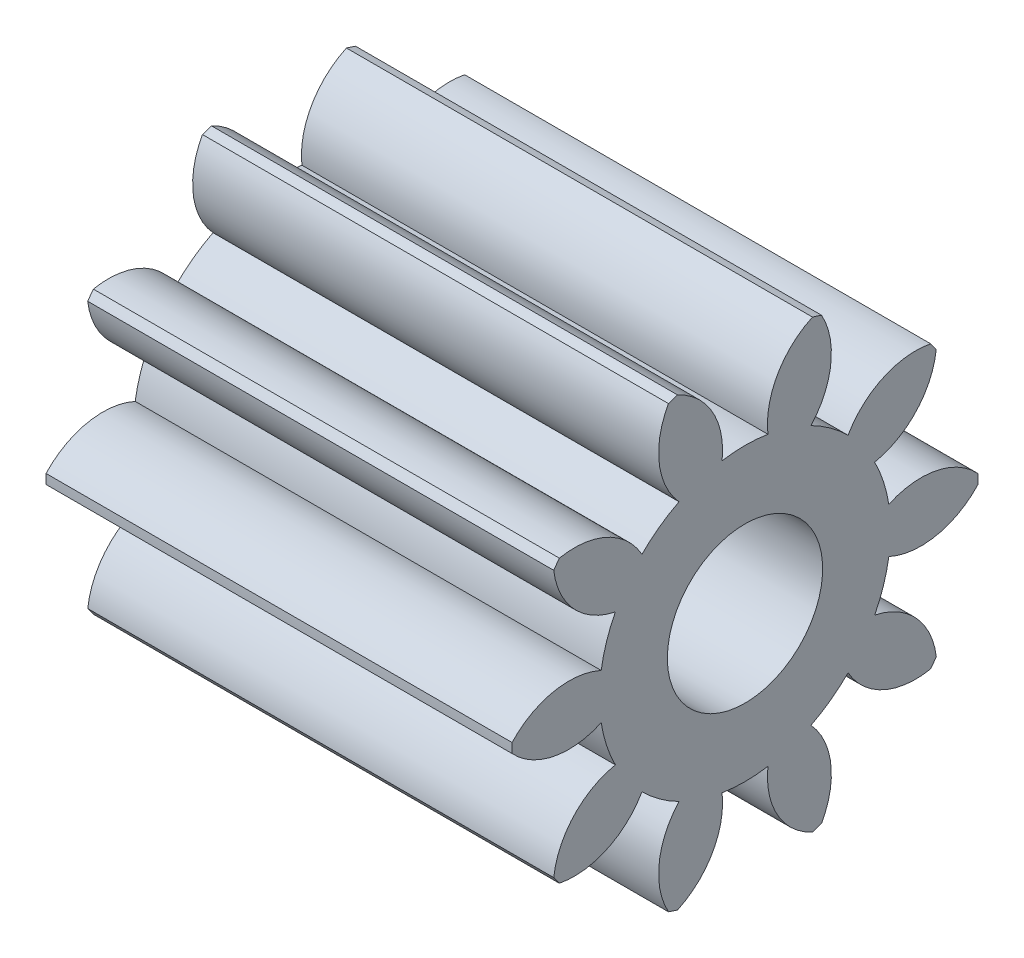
from build123d import *

# Parameters (mm, degrees)
BASPROSKE_W     = 15
BASPROSKE_H     = 7.5
TOOTHCUT_DEPTH  = 19.371173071
TEETHCUTS_COUNT = 10
TEETHCUTS_ANGLE = 324
BORSKE_R        = 2.5
BORE_DEPTH      = 50.0000508


with BuildPart() as part:
    # BasProSke → Base-Revolve (revolve)
    with BuildSketch(Plane(origin=(0, 0, 0), x_dir=(1, 0, 0), z_dir=(0, 1, 0)), mode=Mode.PRIVATE) as base_revolve_sk:
        with Locations((7.5, 3.75)):
            Rectangle(BASPROSKE_W, BASPROSKE_H)
    revolve(base_revolve_sk.sketch.rotate(Axis((-10, 0, 0), (1, 0, 0)), 180), axis=Axis((-10, 0, 0), (1, 0, 0)))

    # TooCutSke → ToothCut (cut, through all)
    with BuildSketch(Plane(origin=(0, 0, 0), x_dir=(0, 0, -1), z_dir=(1, 0, 0))):
        with BuildLine():
            ThreePointArc((0.737676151, 4.628079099), (0, 4.6865), (-0.737676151, 4.628079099))
            ThreePointArc((-0.737676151, 4.628079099), (-1.051542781, 6.151798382), (-2.205760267, 7.194877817))
            ThreePointArc((-2.205760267, 7.194877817), (0, 7.5254), (2.205760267, 7.194877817))
            ThreePointArc((2.205760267, 7.194877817), (1.051542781, 6.151798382), (0.737676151, 4.628079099))
        make_face()
    toothcut = extrude(amount=TOOTHCUT_DEPTH, mode=Mode.SUBTRACT)

    # TeethCuts: ToothCut ×10 about axis
    teethcuts_axis = Axis((-10, 0, 0), (1, 0, 0))
    for i in range(1, TEETHCUTS_COUNT):
        add(toothcut.rotate(teethcuts_axis, i * TEETHCUTS_ANGLE / (TEETHCUTS_COUNT - 1)), mode=Mode.SUBTRACT)

    # BorSke → Bore (cut, symmetric)
    with BuildSketch(Plane(origin=(0, 0, 0), x_dir=(0, 0, -1), z_dir=(1, 0, 0))):
        with Locations(Location((0, 0, 0), (0, 0, 180))):
            Circle(BORSKE_R)
    extrude(amount=BORE_DEPTH, both=True, mode=Mode.SUBTRACT)


solid = part.part
